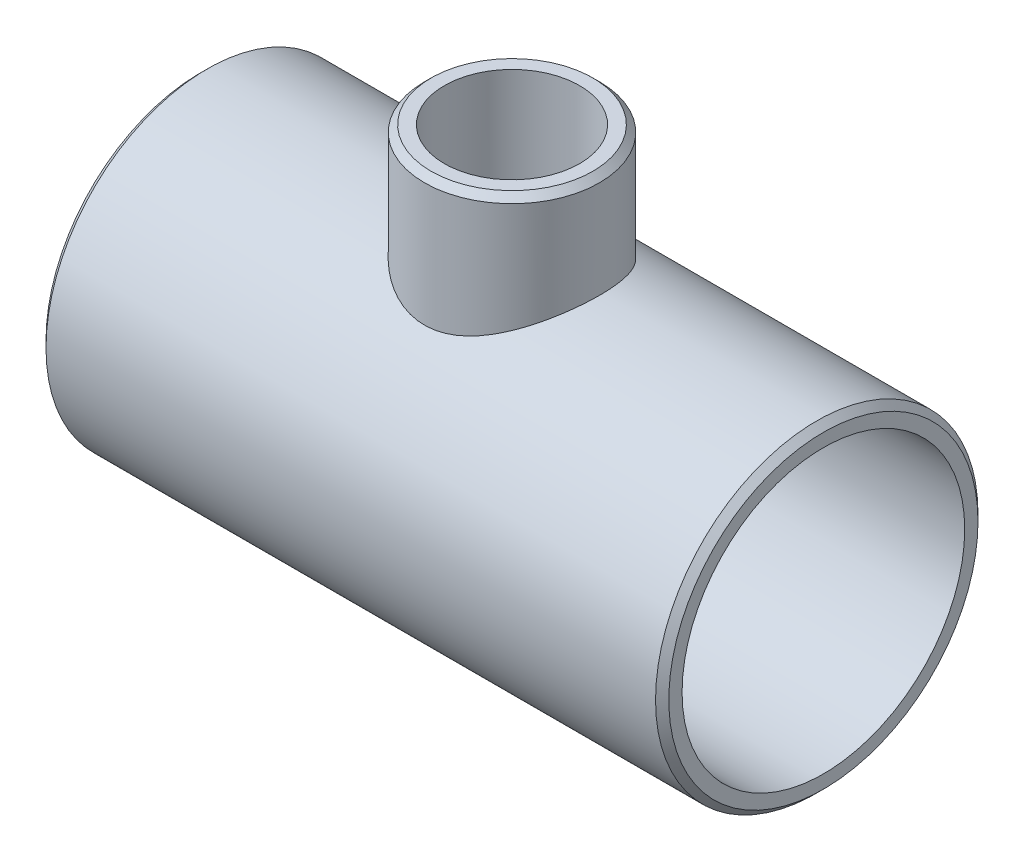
ISO-10303-21;
HEADER;
FILE_DESCRIPTION(('STEP AP214'),'2;1');
FILE_NAME('part.step','',(''),(''),'','','');
FILE_SCHEMA(('AUTOMOTIVE_DESIGN { 1 0 10303 214 1 1 1 1 }'));
ENDSEC;
DATA;
#1=APPLICATION_CONTEXT('core data for automotive mechanical design processes');
#2=APPLICATION_PROTOCOL_DEFINITION('international standard','automotive_design',2000,#1);
#3=PRODUCT_CONTEXT('',#1,'mechanical');
#4=PRODUCT('Part','Part','',(#3));
#5=PRODUCT_RELATED_PRODUCT_CATEGORY('part','',(#4));
#6=PRODUCT_DEFINITION_FORMATION('','',#4);
#7=PRODUCT_DEFINITION_CONTEXT('part definition',#1,'design');
#8=PRODUCT_DEFINITION('design','',#6,#7);
#9=PRODUCT_DEFINITION_SHAPE('','',#8);
#10=(LENGTH_UNIT() NAMED_UNIT(*) SI_UNIT(.MILLI.,.METRE.));
#11=(NAMED_UNIT(*) PLANE_ANGLE_UNIT() SI_UNIT($,.RADIAN.));
#12=(NAMED_UNIT(*) SI_UNIT($,.STERADIAN.) SOLID_ANGLE_UNIT());
#13=UNCERTAINTY_MEASURE_WITH_UNIT(LENGTH_MEASURE(1.E-05),#10,'distance_accuracy_value','');
#14=(GEOMETRIC_REPRESENTATION_CONTEXT(3) GLOBAL_UNCERTAINTY_ASSIGNED_CONTEXT((#13)) GLOBAL_UNIT_ASSIGNED_CONTEXT((#10,
#11,#12)) REPRESENTATION_CONTEXT('',''));
#15=CARTESIAN_POINT('',(0.,0.,0.));
#16=DIRECTION('',(0.,0.,1.));
#17=DIRECTION('',(1.,0.,0.));
#18=AXIS2_PLACEMENT_3D('',#15,#16,#17);
#19=CARTESIAN_POINT('',(-85.852,0.,0.));
#20=DIRECTION('',(-1.,0.,0.));
#21=DIRECTION('',(0.,0.,-1.));
#22=AXIS2_PLACEMENT_3D('',#19,#20,#21);
#23=PLANE('',#22);
#24=CARTESIAN_POINT('',(-85.852,0.,0.));
#25=DIRECTION('',(-1.,0.,0.));
#26=DIRECTION('',(0.,0.,1.));
#27=AXIS2_PLACEMENT_3D('',#24,#25,#26);
#28=CIRCLE('',#27,42.6212);
#29=CARTESIAN_POINT('',(-85.852,0.,42.6212));
#30=VERTEX_POINT('',#29);
#31=EDGE_CURVE('E37',#30,#30,#28,.T.);
#32=ORIENTED_EDGE('',*,*,#31,.T.);
#33=EDGE_LOOP('',(#32));
#34=FACE_BOUND('',#33,.T.);
#35=CARTESIAN_POINT('',(-85.852,0.,0.));
#36=DIRECTION('',(-1.,0.,0.));
#37=DIRECTION('',(0.,0.,1.));
#38=AXIS2_PLACEMENT_3D('',#35,#36,#37);
#39=CIRCLE('',#38,38.9636);
#40=CARTESIAN_POINT('',(-85.852,0.,38.9636));
#41=VERTEX_POINT('',#40);
#42=EDGE_CURVE('E90',#41,#41,#39,.F.);
#43=ORIENTED_EDGE('',*,*,#42,.T.);
#44=EDGE_LOOP('',(#43));
#45=FACE_BOUND('',#44,.T.);
#46=ADVANCED_FACE('F30',(#34,#45),#23,.T.);
#47=CARTESIAN_POINT('',(85.852,0.,0.));
#48=DIRECTION('',(-1.,0.,0.));
#49=DIRECTION('',(0.,0.,1.));
#50=AXIS2_PLACEMENT_3D('',#47,#48,#49);
#51=CYLINDRICAL_SURFACE('',#50,44.45);
#52=CARTESIAN_POINT('',(-84.0232,0.,0.));
#53=DIRECTION('',(-1.,0.,0.));
#54=DIRECTION('',(0.,0.,1.));
#55=AXIS2_PLACEMENT_3D('',#52,#53,#54);
#56=CIRCLE('',#55,44.45);
#57=CARTESIAN_POINT('',(-84.0232,0.,44.45));
#58=VERTEX_POINT('',#57);
#59=EDGE_CURVE('E41',#58,#58,#56,.F.);
#60=ORIENTED_EDGE('',*,*,#59,.T.);
#61=EDGE_LOOP('',(#60));
#62=FACE_BOUND('',#61,.T.);
#63=CARTESIAN_POINT('',(84.0232,0.,0.));
#64=DIRECTION('',(1.,0.,0.));
#65=DIRECTION('',(0.,0.,-1.));
#66=AXIS2_PLACEMENT_3D('',#63,#64,#65);
#67=CIRCLE('',#66,44.45);
#68=CARTESIAN_POINT('',(84.0232,0.,-44.45));
#69=VERTEX_POINT('',#68);
#70=EDGE_CURVE('E45',#69,#69,#67,.F.);
#71=ORIENTED_EDGE('',*,*,#70,.T.);
#72=EDGE_LOOP('',(#71));
#73=FACE_BOUND('',#72,.T.);
#74=CARTESIAN_POINT('',(0.,37.3302236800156,-24.13));
#75=CARTESIAN_POINT('',(-0.62016034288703,37.3302174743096,-24.1300047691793));
#76=CARTESIAN_POINT('',(-1.24026725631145,37.3457277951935,-24.1060636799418));
#77=CARTESIAN_POINT('',(-2.47552218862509,37.4071282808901,-24.0106746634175));
#78=CARTESIAN_POINT('',(-3.09066840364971,37.4530290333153,-23.939210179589));
#79=CARTESIAN_POINT('',(-4.3117937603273,37.5734919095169,-23.7496895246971));
#80=CARTESIAN_POINT('',(-4.91775779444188,37.6480968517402,-23.6315637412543));
#81=CARTESIAN_POINT('',(-6.11525354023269,37.8231542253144,-23.3503504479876));
#82=CARTESIAN_POINT('',(-6.70678610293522,37.9236051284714,-23.1872655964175));
#83=CARTESIAN_POINT('',(-7.86827396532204,38.1461967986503,-22.8192039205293));
#84=CARTESIAN_POINT('',(-8.43833967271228,38.268200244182,-22.6144911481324));
#85=CARTESIAN_POINT('',(-9.55785256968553,38.5305323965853,-22.1645738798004));
#86=CARTESIAN_POINT('',(-10.1072995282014,38.6708613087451,-21.9193689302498));
#87=CARTESIAN_POINT('',(-11.1832762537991,38.9659277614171,-21.3904334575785));
#88=CARTESIAN_POINT('',(-11.7098053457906,39.120665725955,-21.1067018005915));
#89=CARTESIAN_POINT('',(-12.7380539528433,39.4406493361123,-20.5025492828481));
#90=CARTESIAN_POINT('',(-13.239771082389,39.6058959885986,-20.1821249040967));
#91=CARTESIAN_POINT('',(-14.2647106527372,39.9596548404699,-19.4730700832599));
#92=CARTESIAN_POINT('',(-14.7852014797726,40.1488575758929,-19.0808313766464));
#93=CARTESIAN_POINT('',(-15.7921094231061,40.5304727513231,-18.2562233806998));
#94=CARTESIAN_POINT('',(-16.2785248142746,40.7228853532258,-17.8238520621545));
#95=CARTESIAN_POINT('',(-17.2154235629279,41.1063696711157,-16.9206873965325));
#96=CARTESIAN_POINT('',(-17.6658870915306,41.2974405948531,-16.449873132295));
#97=CARTESIAN_POINT('',(-18.5283400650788,41.6736656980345,-15.4719927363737));
#98=CARTESIAN_POINT('',(-18.9403280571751,41.8588196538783,-14.9649252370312));
#99=CARTESIAN_POINT('',(-19.7559792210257,42.233901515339,-13.8730073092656));
#100=CARTESIAN_POINT('',(-20.156098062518,42.4229449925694,-13.285195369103));
#101=CARTESIAN_POINT('',(-20.9049552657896,42.7838182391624,-12.072594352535));
#102=CARTESIAN_POINT('',(-21.2536900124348,42.9556467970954,-11.4478026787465));
#103=CARTESIAN_POINT('',(-21.8960076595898,43.277054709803,-10.1654152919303));
#104=CARTESIAN_POINT('',(-22.1896218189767,43.4266466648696,-9.50783844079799));
#105=CARTESIAN_POINT('',(-22.7183400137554,43.699167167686,-8.16424587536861));
#106=CARTESIAN_POINT('',(-22.9534515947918,43.8220991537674,-7.47823384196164));
#107=CARTESIAN_POINT('',(-23.3452468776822,44.0286360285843,-6.14019522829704));
#108=CARTESIAN_POINT('',(-23.5067574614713,44.1146279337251,-5.48994906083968));
#109=CARTESIAN_POINT('',(-23.7754966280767,44.2584106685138,-4.17524872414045));
#110=CARTESIAN_POINT('',(-23.8827279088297,44.3162028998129,-3.51079526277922));
#111=CARTESIAN_POINT('',(-24.0413116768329,44.401867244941,-2.17374780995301));
#112=CARTESIAN_POINT('',(-24.0926985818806,44.4297577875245,-1.50115909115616));
#113=CARTESIAN_POINT('',(-24.138927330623,44.4548423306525,-0.153489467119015));
#114=CARTESIAN_POINT('',(-24.1337734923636,44.4520386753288,0.521591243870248));
#115=CARTESIAN_POINT('',(-24.0704397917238,44.4176893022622,1.79921394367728));
#116=CARTESIAN_POINT('',(-24.0177342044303,44.3891109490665,2.40211684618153));
#117=CARTESIAN_POINT('',(-23.8674891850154,44.3079973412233,3.60063093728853));
#118=CARTESIAN_POINT('',(-23.7699534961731,44.2554640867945,4.19624273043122));
#119=CARTESIAN_POINT('',(-23.5311764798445,44.1276751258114,5.37615002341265));
#120=CARTESIAN_POINT('',(-23.3899336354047,44.052418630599,5.96044512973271));
#121=CARTESIAN_POINT('',(-23.0652672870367,43.8808975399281,7.11403028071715));
#122=CARTESIAN_POINT('',(-22.8818421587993,43.7846321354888,7.68331974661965));
#123=CARTESIAN_POINT('',(-22.4723297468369,43.5720121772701,8.8099132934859));
#124=CARTESIAN_POINT('',(-22.2457864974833,43.4554441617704,9.36701098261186));
#125=CARTESIAN_POINT('',(-21.7534447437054,43.2054740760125,10.4596188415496));
#126=CARTESIAN_POINT('',(-21.4876464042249,43.0720720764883,10.9951291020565));
#127=CARTESIAN_POINT('',(-20.9188089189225,42.7911322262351,12.0422350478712));
#128=CARTESIAN_POINT('',(-20.6157622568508,42.6435915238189,12.5538258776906));
#129=CARTESIAN_POINT('',(-19.9744855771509,42.3372923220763,13.5509510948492));
#130=CARTESIAN_POINT('',(-19.6362523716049,42.1785328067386,14.0364831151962));
#131=CARTESIAN_POINT('',(-18.8888882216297,41.8355596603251,15.0297353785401));
#132=CARTESIAN_POINT('',(-18.4760425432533,41.6504320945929,15.53434840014));
#133=CARTESIAN_POINT('',(-17.6120971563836,41.274450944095,16.5074020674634));
#134=CARTESIAN_POINT('',(-17.1609950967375,41.0835970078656,16.9758404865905));
#135=CARTESIAN_POINT('',(-16.2223309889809,40.7004409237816,17.8750008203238));
#136=CARTESIAN_POINT('',(-15.7347351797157,40.5081375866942,18.305686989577));
#137=CARTESIAN_POINT('',(-14.7255514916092,40.1269135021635,19.1268995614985));
#138=CARTESIAN_POINT('',(-14.2039621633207,39.9379928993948,19.5174242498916));
#139=CARTESIAN_POINT('',(-13.0835413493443,39.5528144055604,20.2873840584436));
#140=CARTESIAN_POINT('',(-12.4819045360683,39.3572794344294,20.6631125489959));
#141=CARTESIAN_POINT('',(-11.243936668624,38.982352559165,21.3620234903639));
#142=CARTESIAN_POINT('',(-10.6076028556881,38.802961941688,21.6852017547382));
#143=CARTESIAN_POINT('',(-9.304293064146,38.4671228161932,22.2755079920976));
#144=CARTESIAN_POINT('',(-8.63734586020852,38.3106533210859,22.5426873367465));
#145=CARTESIAN_POINT('',(-7.27667718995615,38.0270079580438,23.017947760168));
#146=CARTESIAN_POINT('',(-6.58295998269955,37.8998274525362,23.2260381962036));
#147=CARTESIAN_POINT('',(-5.23138154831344,37.6895758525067,23.5655463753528));
#148=CARTESIAN_POINT('',(-4.57516422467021,37.603767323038,23.7018075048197));
#149=CARTESIAN_POINT('',(-3.25018692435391,37.4656573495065,23.9195267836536));
#150=CARTESIAN_POINT('',(-2.58142774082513,37.4133537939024,24.0009883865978));
#151=CARTESIAN_POINT('',(-1.23819677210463,37.3447356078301,24.107618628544));
#152=CARTESIAN_POINT('',(-0.563730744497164,37.3283882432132,24.1328384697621));
#153=CARTESIAN_POINT('',(0.784796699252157,37.3323863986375,24.1266552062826));
#154=CARTESIAN_POINT('',(1.45885814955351,37.352728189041,24.0952578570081));
#155=CARTESIAN_POINT('',(2.70593275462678,37.4237336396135,23.9847892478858));
#156=CARTESIAN_POINT('',(3.27987820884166,37.4697523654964,23.9130095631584));
#157=CARTESIAN_POINT('',(4.41861510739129,37.586554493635,23.7289971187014));
#158=CARTESIAN_POINT('',(4.98340758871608,37.6573350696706,23.6167689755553));
#159=CARTESIAN_POINT('',(6.10059607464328,37.8213873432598,23.3531412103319));
#160=CARTESIAN_POINT('',(6.65298788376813,37.9146665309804,23.2017285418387));
#161=CARTESIAN_POINT('',(7.74228994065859,38.1208937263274,22.861310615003));
#162=CARTESIAN_POINT('',(8.27919913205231,38.2338430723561,22.6723027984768));
#163=CARTESIAN_POINT('',(9.3578168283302,38.4815154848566,22.2494498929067));
#164=CARTESIAN_POINT('',(9.89873795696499,38.6169662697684,22.0140255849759));
#165=CARTESIAN_POINT('',(10.9588868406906,38.9022114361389,21.5059363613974));
#166=CARTESIAN_POINT('',(11.4781123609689,39.0520072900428,21.2332676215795));
#167=CARTESIAN_POINT('',(12.4931490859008,39.3623011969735,20.6523650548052));
#168=CARTESIAN_POINT('',(12.9889523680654,39.522802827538,20.3441193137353));
#169=CARTESIAN_POINT('',(13.9553711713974,39.8508639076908,19.6937506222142));
#170=CARTESIAN_POINT('',(14.4259848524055,40.0184238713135,19.3516252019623));
#171=CARTESIAN_POINT('',(15.4108232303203,40.3831510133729,18.5798979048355));
#172=CARTESIAN_POINT('',(15.9206370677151,40.5809112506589,18.1449325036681));
#173=CARTESIAN_POINT('',(16.9024665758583,40.9760537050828,17.2340367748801));
#174=CARTESIAN_POINT('',(17.3744788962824,41.1734358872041,16.7581028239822));
#175=CARTESIAN_POINT('',(18.2785183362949,41.5630047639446,15.7671395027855));
#176=CARTESIAN_POINT('',(18.7105236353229,41.7551885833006,15.2520890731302));
#177=CARTESIAN_POINT('',(19.5316240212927,42.1295195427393,14.1853996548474));
#178=CARTESIAN_POINT('',(19.9207189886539,42.3116666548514,13.6337605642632));
#179=CARTESIAN_POINT('',(20.6702933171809,42.6695809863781,12.4698467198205));
#180=CARTESIAN_POINT('',(21.0285833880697,42.8446514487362,11.8559427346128));
#181=CARTESIAN_POINT('',(21.6915528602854,43.1739072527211,10.5943926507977));
#182=CARTESIAN_POINT('',(21.996229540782,43.3280915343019,9.94674484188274));
#183=CARTESIAN_POINT('',(22.5481874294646,43.6108955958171,8.62265248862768));
#184=CARTESIAN_POINT('',(22.7955158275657,43.739536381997,7.94623216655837));
#185=CARTESIAN_POINT('',(23.22971967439,43.9673886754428,6.56945924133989));
#186=CARTESIAN_POINT('',(23.416603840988,44.0666044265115,5.86911010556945));
#187=CARTESIAN_POINT('',(23.7114588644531,44.224032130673,4.52216606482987));
#188=CARTESIAN_POINT('',(23.8254789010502,44.2853659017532,3.87725514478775));
#189=CARTESIAN_POINT('',(24.0008089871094,44.3799385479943,2.57826860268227));
#190=CARTESIAN_POINT('',(24.0621226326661,44.4131793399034,1.92419360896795));
#191=CARTESIAN_POINT('',(24.1311542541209,44.450617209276,0.612667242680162));
#192=CARTESIAN_POINT('',(24.1388945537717,44.4548263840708,-0.0447826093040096));
#193=CARTESIAN_POINT('',(24.1007239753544,44.4341110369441,-1.35764534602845));
#194=CARTESIAN_POINT('',(24.0548155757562,44.4091878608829,-2.01305832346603));
#195=CARTESIAN_POINT('',(23.9162518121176,44.3342945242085,-3.26021809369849));
#196=CARTESIAN_POINT('',(23.827951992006,44.2866604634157,-3.85259654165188));
#197=CARTESIAN_POINT('',(23.608125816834,44.1687739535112,-5.02693734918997));
#198=CARTESIAN_POINT('',(23.4766026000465,44.0985231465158,-5.60890046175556));
#199=CARTESIAN_POINT('',(23.1717402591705,43.9369827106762,-6.75878762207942));
#200=CARTESIAN_POINT('',(22.9983986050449,43.8456918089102,-7.32671081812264));
#201=CARTESIAN_POINT('',(22.6116115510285,43.6440528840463,-8.4452444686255));
#202=CARTESIAN_POINT('',(22.3981642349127,43.533703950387,-8.99585409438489));
#203=CARTESIAN_POINT('',(21.924745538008,43.2919989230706,-10.0962309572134));
#204=CARTESIAN_POINT('',(21.6633849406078,43.160033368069,-10.6452659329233));
#205=CARTESIAN_POINT('',(21.101845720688,42.8809298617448,-11.7190504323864));
#206=CARTESIAN_POINT('',(20.8016666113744,42.7337917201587,-12.243799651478));
#207=CARTESIAN_POINT('',(20.1645438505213,42.4273073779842,-13.2669275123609));
#208=CARTESIAN_POINT('',(19.827589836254,42.2679577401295,-13.7652986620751));
#209=CARTESIAN_POINT('',(19.1190091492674,41.9402364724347,-14.7336491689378));
#210=CARTESIAN_POINT('',(18.7473788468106,41.7718638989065,-15.2036255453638));
#211=CARTESIAN_POINT('',(17.9274619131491,41.4100138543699,-16.1649610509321));
#212=CARTESIAN_POINT('',(17.4752591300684,41.2158506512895,-16.6527276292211));
#213=CARTESIAN_POINT('',(16.5326887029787,40.8251324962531,-17.5888711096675));
#214=CARTESIAN_POINT('',(16.0423181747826,40.628577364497,-18.0372450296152));
#215=CARTESIAN_POINT('',(15.0250855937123,40.2377690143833,-18.8930138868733));
#216=CARTESIAN_POINT('',(14.4981813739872,40.0435187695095,-19.3003600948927));
#217=CARTESIAN_POINT('',(13.4106542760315,39.6627263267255,-20.0712603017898));
#218=CARTESIAN_POINT('',(12.8500331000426,39.4761837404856,-20.4348165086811));
#219=CARTESIAN_POINT('',(11.6621001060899,39.1051497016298,-21.1366231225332));
#220=CARTESIAN_POINT('',(11.0328064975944,38.9214812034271,-21.4719666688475));
#221=CARTESIAN_POINT('',(9.74200471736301,38.5754553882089,-22.0875881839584));
#222=CARTESIAN_POINT('',(9.0804910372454,38.4131017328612,-22.367856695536));
#223=CARTESIAN_POINT('',(7.73135599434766,38.1167656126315,-22.8691790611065));
#224=CARTESIAN_POINT('',(7.04381306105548,37.9827048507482,-23.0903967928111));
#225=CARTESIAN_POINT('',(5.64659404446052,37.7485887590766,-23.471187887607));
#226=CARTESIAN_POINT('',(4.93693264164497,37.6485113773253,-23.6308012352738));
#227=CARTESIAN_POINT('',(3.52616960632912,37.490066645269,-23.881345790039));
#228=CARTESIAN_POINT('',(2.82559802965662,37.4303962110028,-23.9744287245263));
#229=CARTESIAN_POINT('',(1.41666111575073,37.3504780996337,-24.0987533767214));
#230=CARTESIAN_POINT('',(0.708295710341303,37.3302307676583,-24.1299945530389));
#231=CARTESIAN_POINT('',(0.,37.3302236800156,-24.13));
#232=B_SPLINE_CURVE_WITH_KNOTS('',3,(#74,#75,#76,#77,#78,#79,#80,#81,#82,#83,#84,#85,#86,#87,
#88,#89,#90,#91,#92,#93,#94,#95,#96,#97,#98,#99,#100,#101,#102,#103,#104,#105,#106,#107,#108,
#109,#110,#111,#112,#113,#114,#115,#116,#117,#118,#119,#120,#121,#122,#123,#124,#125,#126,#127,
#128,#129,#130,#131,#132,#133,#134,#135,#136,#137,#138,#139,#140,#141,#142,#143,#144,#145,#146,
#147,#148,#149,#150,#151,#152,#153,#154,#155,#156,#157,#158,#159,#160,#161,#162,#163,#164,#165,
#166,#167,#168,#169,#170,#171,#172,#173,#174,#175,#176,#177,#178,#179,#180,#181,#182,#183,#184,
#185,#186,#187,#188,#189,#190,#191,#192,#193,#194,#195,#196,#197,#198,#199,#200,#201,#202,#203,
#204,#205,#206,#207,#208,#209,#210,#211,#212,#213,#214,#215,#216,#217,#218,#219,#220,#221,#222,
#223,#224,#225,#226,#227,#228,#229,#230,#231),.UNSPECIFIED.,.T.,.F.,(4,2,2,2,2,2,2,2,2,2,2,2,2,
2,2,2,2,2,2,2,2,2,2,2,2,2,2,2,2,2,2,2,2,2,2,2,2,2,2,2,2,2,2,2,2,2,2,2,2,2,2,2,2,2,2,2,2,2,2,2,2,
2,2,2,2,2,2,2,2,2,2,2,2,2,2,2,2,2,4),(0.,1.85974112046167,3.7201304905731,5.58330585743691,
7.44637108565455,9.29796793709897,11.1495855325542,13.0012576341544,14.8531074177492,
16.8869351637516,18.9208658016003,20.9559105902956,22.9910321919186,25.1954712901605,
27.4000654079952,29.6034054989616,31.8064612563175,33.8301502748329,35.8537386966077,
37.8760792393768,39.8982653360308,41.7137397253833,43.5290625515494,45.3444483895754,
47.159904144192,48.9957475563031,50.8315832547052,52.6677900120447,54.5041632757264,
56.5352770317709,58.5665157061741,60.5996573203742,62.6328856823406,64.8374231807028,
67.04213621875,69.2448177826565,71.4471503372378,73.4711872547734,75.4950966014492,
77.5171626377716,79.5390231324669,81.2777572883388,83.0162930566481,84.7554084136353,
86.4946421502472,88.3087050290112,90.1229543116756,91.9378129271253,93.7528039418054,
95.8466915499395,97.9407645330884,100.035973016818,102.131187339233,104.324389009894,
106.517701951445,108.709203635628,110.900389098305,112.871043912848,114.841564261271,
116.811263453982,118.78087165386,120.581246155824,122.381489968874,124.181842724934,
125.982281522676,127.847015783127,129.711773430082,131.577057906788,133.4425378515,
135.518985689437,137.595590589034,139.674633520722,141.753571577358,143.959635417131,
146.166077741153,148.366331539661,150.565154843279,152.689178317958,154.813220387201),.UNSPECIFIED.);
#233=CARTESIAN_POINT('',(0.,37.3302236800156,-24.13));
#234=VERTEX_POINT('',#233);
#235=EDGE_CURVE('E56',#234,#234,#232,.T.);
#236=ORIENTED_EDGE('',*,*,#235,.F.);
#237=EDGE_LOOP('',(#236));
#238=FACE_BOUND('',#237,.T.);
#239=ADVANCED_FACE('F66',(#62,#73,#238),#51,.T.);
#240=CARTESIAN_POINT('',(85.852,0.,0.));
#241=DIRECTION('',(1.,0.,0.));
#242=DIRECTION('',(0.,0.,-1.));
#243=AXIS2_PLACEMENT_3D('',#240,#241,#242);
#244=PLANE('',#243);
#245=CARTESIAN_POINT('',(85.852,0.,0.));
#246=DIRECTION('',(1.,0.,0.));
#247=DIRECTION('',(0.,0.,-1.));
#248=AXIS2_PLACEMENT_3D('',#245,#246,#247);
#249=CIRCLE('',#248,42.6212);
#250=CARTESIAN_POINT('',(85.852,0.,-42.6212));
#251=VERTEX_POINT('',#250);
#252=EDGE_CURVE('E10',#251,#251,#249,.T.);
#253=ORIENTED_EDGE('',*,*,#252,.T.);
#254=EDGE_LOOP('',(#253));
#255=FACE_BOUND('',#254,.T.);
#256=CARTESIAN_POINT('',(85.852,0.,0.));
#257=DIRECTION('',(1.,0.,0.));
#258=DIRECTION('',(0.,0.,-1.));
#259=AXIS2_PLACEMENT_3D('',#256,#257,#258);
#260=CIRCLE('',#259,38.9636);
#261=CARTESIAN_POINT('',(85.852,0.,-38.9636));
#262=VERTEX_POINT('',#261);
#263=EDGE_CURVE('E88',#262,#262,#260,.T.);
#264=ORIENTED_EDGE('',*,*,#263,.F.);
#265=EDGE_LOOP('',(#264));
#266=FACE_BOUND('',#265,.T.);
#267=ADVANCED_FACE('F76',(#255,#266),#244,.T.);
#268=CARTESIAN_POINT('',(0.,73.152,0.));
#269=DIRECTION('',(0.,-1.,0.));
#270=DIRECTION('',(0.,0.,-1.));
#271=AXIS2_PLACEMENT_3D('',#268,#269,#270);
#272=CYLINDRICAL_SURFACE('',#271,24.13);
#273=CARTESIAN_POINT('',(0.,71.3232,0.));
#274=DIRECTION('',(0.,1.,0.));
#275=DIRECTION('',(0.,0.,1.));
#276=AXIS2_PLACEMENT_3D('',#273,#274,#275);
#277=CIRCLE('',#276,24.13);
#278=CARTESIAN_POINT('',(0.,71.3232,24.13));
#279=VERTEX_POINT('',#278);
#280=EDGE_CURVE('E50',#279,#279,#277,.F.);
#281=ORIENTED_EDGE('',*,*,#280,.T.);
#282=EDGE_LOOP('',(#281));
#283=FACE_BOUND('',#282,.T.);
#284=ORIENTED_EDGE('',*,*,#235,.T.);
#285=EDGE_LOOP('',(#284));
#286=FACE_BOUND('',#285,.T.);
#287=ADVANCED_FACE('F70',(#283,#286),#272,.T.);
#288=CARTESIAN_POINT('',(0.,73.152,0.));
#289=DIRECTION('',(0.,1.,0.));
#290=DIRECTION('',(0.,0.,1.));
#291=AXIS2_PLACEMENT_3D('',#288,#289,#290);
#292=PLANE('',#291);
#293=CARTESIAN_POINT('',(0.,73.152,0.));
#294=DIRECTION('',(0.,1.,0.));
#295=DIRECTION('',(0.,0.,1.));
#296=AXIS2_PLACEMENT_3D('',#293,#294,#295);
#297=CIRCLE('',#296,22.3012);
#298=CARTESIAN_POINT('',(0.,73.152,22.3012));
#299=VERTEX_POINT('',#298);
#300=EDGE_CURVE('E53',#299,#299,#297,.T.);
#301=ORIENTED_EDGE('',*,*,#300,.T.);
#302=EDGE_LOOP('',(#301));
#303=FACE_BOUND('',#302,.T.);
#304=CARTESIAN_POINT('',(0.,73.152,0.));
#305=DIRECTION('',(0.,1.,0.));
#306=DIRECTION('',(0.,0.,1.));
#307=AXIS2_PLACEMENT_3D('',#304,#305,#306);
#308=CIRCLE('',#307,18.6436);
#309=CARTESIAN_POINT('',(0.,73.152,18.6436));
#310=VERTEX_POINT('',#309);
#311=EDGE_CURVE('E64',#310,#310,#308,.T.);
#312=ORIENTED_EDGE('',*,*,#311,.F.);
#313=EDGE_LOOP('',(#312));
#314=FACE_BOUND('',#313,.T.);
#315=ADVANCED_FACE('F75',(#303,#314),#292,.T.);
#316=CARTESIAN_POINT('',(85.852,0.,0.));
#317=DIRECTION('',(-1.,0.,0.));
#318=DIRECTION('',(0.,0.,1.));
#319=AXIS2_PLACEMENT_3D('',#316,#317,#318);
#320=CYLINDRICAL_SURFACE('',#319,38.9636);
#321=ORIENTED_EDGE('',*,*,#42,.F.);
#322=EDGE_LOOP('',(#321));
#323=FACE_BOUND('',#322,.T.);
#324=ORIENTED_EDGE('',*,*,#263,.T.);
#325=EDGE_LOOP('',(#324));
#326=FACE_BOUND('',#325,.T.);
#327=CARTESIAN_POINT('',(1.76904412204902,34.2594194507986,18.5594801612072));
#328=CARTESIAN_POINT('',(2.27005178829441,34.2852947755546,18.511721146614));
#329=CARTESIAN_POINT('',(2.76869139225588,34.3220373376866,18.44369501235));
#330=CARTESIAN_POINT('',(3.75720921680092,34.4158750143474,18.2679912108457));
#331=CARTESIAN_POINT('',(4.24708173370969,34.4729829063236,18.1602886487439));
#332=CARTESIAN_POINT('',(5.21546552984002,34.6056173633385,17.9062538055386));
#333=CARTESIAN_POINT('',(5.69394534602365,34.6811896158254,17.7598256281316));
#334=CARTESIAN_POINT('',(6.63507249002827,34.8480696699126,17.4300962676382));
#335=CARTESIAN_POINT('',(7.09772200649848,34.9393752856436,17.2468002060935));
#336=CARTESIAN_POINT('',(8.00209941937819,35.134284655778,16.8461709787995));
#337=CARTESIAN_POINT('',(8.44392984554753,35.2378167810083,16.6290338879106));
#338=CARTESIAN_POINT('',(9.30723077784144,35.4545938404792,16.1616901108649));
#339=CARTESIAN_POINT('',(9.72870076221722,35.5678390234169,15.9114825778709));
#340=CARTESIAN_POINT('',(10.5492404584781,35.8009785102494,15.3797363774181));
#341=CARTESIAN_POINT('',(10.9483168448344,35.9208708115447,15.0982071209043));
#342=CARTESIAN_POINT('',(11.7224881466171,36.1643469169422,14.505338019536));
#343=CARTESIAN_POINT('',(12.0975817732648,36.2879309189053,14.1939965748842));
#344=CARTESIAN_POINT('',(12.8509573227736,36.5457294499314,13.5171415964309));
#345=CARTESIAN_POINT('',(13.2271194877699,36.6800076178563,13.149288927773));
#346=CARTESIAN_POINT('',(13.9474782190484,36.9458844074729,12.3825837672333));
#347=CARTESIAN_POINT('',(14.2916731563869,37.0774828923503,11.9837296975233));
#348=CARTESIAN_POINT('',(14.9460289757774,37.3345889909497,11.1569716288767));
#349=CARTESIAN_POINT('',(15.2561808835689,37.4600949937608,10.7290600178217));
#350=CARTESIAN_POINT('',(15.8401062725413,37.7016791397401,9.84656169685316));
#351=CARTESIAN_POINT('',(16.113880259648,37.8177574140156,9.39197535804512));
#352=CARTESIAN_POINT('',(16.6261984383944,38.0388570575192,8.45242379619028));
#353=CARTESIAN_POINT('',(16.864217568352,38.1437081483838,7.96713149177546));
#354=CARTESIAN_POINT('',(17.2981680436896,38.3375431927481,6.97497990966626));
#355=CARTESIAN_POINT('',(17.4940984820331,38.426526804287,6.46812016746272));
#356=CARTESIAN_POINT('',(17.8415169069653,38.585932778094,5.43690268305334));
#357=CARTESIAN_POINT('',(17.9930337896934,38.6563672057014,4.91255656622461));
#358=CARTESIAN_POINT('',(18.2498500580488,38.7765705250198,3.85035700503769));
#359=CARTESIAN_POINT('',(18.3551543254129,38.8263415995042,3.31250499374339));
#360=CARTESIAN_POINT('',(18.5108990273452,38.9002243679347,2.27603078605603));
#361=CARTESIAN_POINT('',(18.5653666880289,38.9262154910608,1.7781440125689));
#362=CARTESIAN_POINT('',(18.6340471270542,38.959018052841,0.778982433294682));
#363=CARTESIAN_POINT('',(18.648262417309,38.9658306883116,0.277707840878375));
#364=CARTESIAN_POINT('',(18.6362651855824,38.960090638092,-0.724121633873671));
#365=CARTESIAN_POINT('',(18.6100621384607,38.9475424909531,-1.22467665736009));
#366=CARTESIAN_POINT('',(18.5175706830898,38.9034326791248,-2.22121436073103));
#367=CARTESIAN_POINT('',(18.4512828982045,38.871871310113,-2.7171971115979));
#368=CARTESIAN_POINT('',(18.2839747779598,38.7927432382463,-3.67473683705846));
#369=CARTESIAN_POINT('',(18.1849772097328,38.7461114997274,-4.13672700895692));
#370=CARTESIAN_POINT('',(17.9527622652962,38.6376686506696,-5.0501696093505));
#371=CARTESIAN_POINT('',(17.8195464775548,38.5758582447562,-5.50162252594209));
#372=CARTESIAN_POINT('',(17.5201343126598,38.4384667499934,-6.39132687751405));
#373=CARTESIAN_POINT('',(17.3539347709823,38.3628843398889,-6.8295770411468));
#374=CARTESIAN_POINT('',(16.9899801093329,38.1996241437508,-7.69043654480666));
#375=CARTESIAN_POINT('',(16.7922235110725,38.1119457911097,-8.11304515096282));
#376=CARTESIAN_POINT('',(16.3562831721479,37.921840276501,-8.96068622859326));
#377=CARTESIAN_POINT('',(16.1165982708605,37.8189023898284,-9.38483192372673));
#378=CARTESIAN_POINT('',(15.6059529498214,37.6041277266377,-10.2114694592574));
#379=CARTESIAN_POINT('',(15.3349918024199,37.4922907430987,-10.6139607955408));
#380=CARTESIAN_POINT('',(14.7634516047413,37.2621707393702,-11.3955596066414));
#381=CARTESIAN_POINT('',(14.4628637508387,37.143885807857,-11.7746600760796));
#382=CARTESIAN_POINT('',(13.833722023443,36.9034637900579,-12.5078133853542));
#383=CARTESIAN_POINT('',(13.5051581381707,36.781325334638,-12.8618571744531));
#384=CARTESIAN_POINT('',(12.7905347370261,36.5247169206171,-13.5743634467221));
#385=CARTESIAN_POINT('',(12.4019648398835,36.3901398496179,-13.9302742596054));
#386=CARTESIAN_POINT('',(11.5956100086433,36.1232852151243,-14.6083256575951));
#387=CARTESIAN_POINT('',(11.1778225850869,35.9910078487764,-14.9304633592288));
#388=CARTESIAN_POINT('',(10.3149429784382,35.7324345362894,-15.5391331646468));
#389=CARTESIAN_POINT('',(9.86983641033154,35.60614180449,-15.8256462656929));
#390=CARTESIAN_POINT('',(8.95501604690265,35.3634875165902,-16.3606895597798));
#391=CARTESIAN_POINT('',(8.48531298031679,35.2471216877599,-16.6092361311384));
#392=CARTESIAN_POINT('',(7.51762945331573,35.0266810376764,-17.0692608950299));
#393=CARTESIAN_POINT('',(7.01936585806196,34.9227808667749,-17.2802288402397));
#394=CARTESIAN_POINT('',(6.00331821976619,34.7328256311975,-17.6589323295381));
#395=CARTESIAN_POINT('',(5.48553383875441,34.6467708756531,-17.8266671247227));
#396=CARTESIAN_POINT('',(4.43491433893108,34.4960415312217,-18.1166214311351));
#397=CARTESIAN_POINT('',(3.90209628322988,34.4313436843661,-18.2388904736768));
#398=CARTESIAN_POINT('',(2.82548411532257,34.3260090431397,-18.436372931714));
#399=CARTESIAN_POINT('',(2.28169156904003,34.2853688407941,-18.5115930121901));
#400=CARTESIAN_POINT('',(1.24715980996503,34.2329688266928,-18.6082933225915));
#401=CARTESIAN_POINT('',(0.757006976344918,34.2185723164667,-18.634684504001));
#402=CARTESIAN_POINT('',(-0.22400007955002,34.2109338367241,-18.6487057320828));
#403=CARTESIAN_POINT('',(-0.714854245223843,34.2176902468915,-18.6363387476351));
#404=CARTESIAN_POINT('',(-1.69329043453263,34.2521014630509,-18.5730165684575));
#405=CARTESIAN_POINT('',(-2.18087260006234,34.2797553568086,-18.5220630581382));
#406=CARTESIAN_POINT('',(-3.14900210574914,34.3549354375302,-18.3822418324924));
#407=CARTESIAN_POINT('',(-3.62954944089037,34.4024616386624,-18.2933740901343));
#408=CARTESIAN_POINT('',(-4.5541298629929,34.5125960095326,-18.0846877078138));
#409=CARTESIAN_POINT('',(-4.9987231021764,34.5742378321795,-17.9668262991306));
#410=CARTESIAN_POINT('',(-5.87609966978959,34.7119439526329,-17.6993132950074));
#411=CARTESIAN_POINT('',(-6.30887886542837,34.7880132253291,-17.5496507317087));
#412=CARTESIAN_POINT('',(-7.16015620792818,34.9524206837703,-17.2198815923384));
#413=CARTESIAN_POINT('',(-7.57865682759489,35.040756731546,-17.0397803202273));
#414=CARTESIAN_POINT('',(-8.39972757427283,35.2274578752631,-16.6503742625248));
#415=CARTESIAN_POINT('',(-8.80229043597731,35.3258274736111,-16.4410563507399));
#416=CARTESIAN_POINT('',(-9.62469927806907,35.5392980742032,-15.9747261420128));
#417=CARTESIAN_POINT('',(-10.0428954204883,35.65510899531,-15.715127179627));
#418=CARTESIAN_POINT('',(-10.8563418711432,35.8927165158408,-15.1645937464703));
#419=CARTESIAN_POINT('',(-11.2515904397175,36.0145135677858,-14.8736569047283));
#420=CARTESIAN_POINT('',(-12.0176531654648,36.2611456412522,-14.2618469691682));
#421=CARTESIAN_POINT('',(-12.3884504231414,36.3859826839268,-13.9409535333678));
#422=CARTESIAN_POINT('',(-13.1035141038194,36.6356132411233,-13.2710847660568));
#423=CARTESIAN_POINT('',(-13.4477887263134,36.7604067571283,-12.922118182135));
#424=CARTESIAN_POINT('',(-14.1396039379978,37.0188355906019,-12.1632003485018));
#425=CARTESIAN_POINT('',(-14.4843569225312,37.1521868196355,-11.7506041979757));
#426=CARTESIAN_POINT('',(-15.137917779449,37.4118284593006,-10.8957227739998));
#427=CARTESIAN_POINT('',(-15.4467231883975,37.5381183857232,-10.4534354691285));
#428=CARTESIAN_POINT('',(-16.0259544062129,37.7801572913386,-9.54171016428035));
#429=CARTESIAN_POINT('',(-16.2963844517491,37.8959074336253,-9.07227516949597));
#430=CARTESIAN_POINT('',(-16.7964507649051,38.1136245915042,-8.10909675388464));
#431=CARTESIAN_POINT('',(-17.0260894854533,38.2155924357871,-7.61535479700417));
#432=CARTESIAN_POINT('',(-17.436272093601,38.4001210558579,-6.62125854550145));
#433=CARTESIAN_POINT('',(-17.6180263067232,38.4831512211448,-6.12149147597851));
#434=CARTESIAN_POINT('',(-17.9387465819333,38.6310323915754,-5.10576044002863));
#435=CARTESIAN_POINT('',(-18.0777130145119,38.695883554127,-4.58979661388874));
#436=CARTESIAN_POINT('',(-18.3110523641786,38.8054419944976,-3.54611379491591));
#437=CARTESIAN_POINT('',(-18.4054537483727,38.850162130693,-3.01840253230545));
#438=CARTESIAN_POINT('',(-18.5485170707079,38.9181423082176,-1.9554616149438));
#439=CARTESIAN_POINT('',(-18.5971831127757,38.9414042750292,-1.42023263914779));
#440=CARTESIAN_POINT('',(-18.645758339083,38.9646281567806,-0.396643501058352));
#441=CARTESIAN_POINT('',(-18.6497525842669,38.9665422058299,0.09148366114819));
#442=CARTESIAN_POINT('',(-18.6194696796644,38.952057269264,1.06625365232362));
#443=CARTESIAN_POINT('',(-18.5851952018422,38.9356595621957,1.55289658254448));
#444=CARTESIAN_POINT('',(-18.4787817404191,38.8849778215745,2.52103236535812));
#445=CARTESIAN_POINT('',(-18.406645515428,38.8506950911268,3.0025255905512));
#446=CARTESIAN_POINT('',(-18.2253232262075,38.7651174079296,3.95693918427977));
#447=CARTESIAN_POINT('',(-18.116136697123,38.7138222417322,4.42985944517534));
#448=CARTESIAN_POINT('',(-17.8647104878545,38.5968146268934,5.35349553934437));
#449=CARTESIAN_POINT('',(-17.7232615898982,38.5314489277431,5.80447133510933));
#450=CARTESIAN_POINT('',(-17.4073817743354,38.3871789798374,6.69245551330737));
#451=CARTESIAN_POINT('',(-17.2329516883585,38.308275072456,7.12946424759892));
#452=CARTESIAN_POINT('',(-16.8525460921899,38.1386632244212,7.98721941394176));
#453=CARTESIAN_POINT('',(-16.6465654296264,38.0479533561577,8.40796317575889));
#454=CARTESIAN_POINT('',(-16.2046184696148,37.8566808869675,9.23105607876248));
#455=CARTESIAN_POINT('',(-15.9686506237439,37.7561177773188,9.63340426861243));
#456=CARTESIAN_POINT('',(-15.4502174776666,37.5396870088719,10.4462156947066));
#457=CARTESIAN_POINT('',(-15.1656253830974,37.4232385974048,10.8551685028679));
#458=CARTESIAN_POINT('',(-14.5656384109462,37.1841421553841,11.6478810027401));
#459=CARTESIAN_POINT('',(-14.2502422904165,37.0614938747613,12.0316396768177));
#460=CARTESIAN_POINT('',(-13.5903601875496,36.8128072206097,12.7723143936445));
#461=CARTESIAN_POINT('',(-13.2458651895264,36.6867678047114,13.1292220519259));
#462=CARTESIAN_POINT('',(-12.5294635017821,36.4342331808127,13.8145660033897));
#463=CARTESIAN_POINT('',(-12.1575436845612,36.307737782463,14.1429884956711));
#464=CARTESIAN_POINT('',(-11.3569022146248,36.047231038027,14.7950096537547));
#465=CARTESIAN_POINT('',(-10.9260204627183,35.9134433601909,15.1160515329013));
#466=CARTESIAN_POINT('',(-10.0368727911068,35.6530020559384,15.7204915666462));
#467=CARTESIAN_POINT('',(-9.57861947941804,35.526345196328,16.0039068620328));
#468=CARTESIAN_POINT('',(-8.63675747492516,35.2840578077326,16.5312330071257));
#469=CARTESIAN_POINT('',(-8.15313518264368,35.1684332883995,16.7751223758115));
#470=CARTESIAN_POINT('',(-7.16367233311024,34.9523040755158,17.2209169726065));
#471=CARTESIAN_POINT('',(-6.65783408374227,34.8517978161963,17.4228265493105));
#472=CARTESIAN_POINT('',(-5.64276868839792,34.6724268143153,17.7770416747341));
#473=CARTESIAN_POINT('',(-5.13409613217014,34.5930043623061,17.9306510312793));
#474=CARTESIAN_POINT('',(-4.10269832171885,34.4550338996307,18.1943667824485));
#475=CARTESIAN_POINT('',(-3.57997121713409,34.3964886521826,18.3044674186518));
#476=CARTESIAN_POINT('',(-2.52643732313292,34.3028667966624,18.4793205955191));
#477=CARTESIAN_POINT('',(-1.99565754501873,34.2677243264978,18.5442004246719));
#478=CARTESIAN_POINT('',(-0.929697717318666,34.2222086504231,18.6280685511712));
#479=CARTESIAN_POINT('',(-0.394521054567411,34.2118178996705,18.6470893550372));
#480=CARTESIAN_POINT('',(0.41232903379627,34.2151141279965,18.641028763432));
#481=CARTESIAN_POINT('',(0.684297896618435,34.2194805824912,18.6330221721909));
#482=CARTESIAN_POINT('',(1.22742253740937,34.2346492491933,18.6051384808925));
#483=CARTESIAN_POINT('',(1.49857839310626,34.2454508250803,18.5852625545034));
#484=CARTESIAN_POINT('',(1.76904412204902,34.2594194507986,18.5594801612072));
#485=B_SPLINE_CURVE_WITH_KNOTS('',3,(#327,#328,#329,#330,#331,#332,#333,#334,#335,#336,#337,
#338,#339,#340,#341,#342,#343,#344,#345,#346,#347,#348,#349,#350,#351,#352,#353,#354,#355,#356,
#357,#358,#359,#360,#361,#362,#363,#364,#365,#366,#367,#368,#369,#370,#371,#372,#373,#374,#375,
#376,#377,#378,#379,#380,#381,#382,#383,#384,#385,#386,#387,#388,#389,#390,#391,#392,#393,#394,
#395,#396,#397,#398,#399,#400,#401,#402,#403,#404,#405,#406,#407,#408,#409,#410,#411,#412,#413,
#414,#415,#416,#417,#418,#419,#420,#421,#422,#423,#424,#425,#426,#427,#428,#429,#430,#431,#432,
#433,#434,#435,#436,#437,#438,#439,#440,#441,#442,#443,#444,#445,#446,#447,#448,#449,#450,#451,
#452,#453,#454,#455,#456,#457,#458,#459,#460,#461,#462,#463,#464,#465,#466,#467,#468,#469,#470,
#471,#472,#473,#474,#475,#476,#477,#478,#479,#480,#481,#482,#483,#484),.UNSPECIFIED.,.T.,.F.,(4,
2,2,2,2,2,2,2,2,2,2,2,2,2,2,2,2,2,2,2,2,2,2,2,2,2,2,2,2,2,2,2,2,2,2,2,2,2,2,2,2,2,2,2,2,2,2,2,2,
2,2,2,2,2,2,2,2,2,2,2,2,2,2,2,2,2,2,2,2,2,2,2,2,2,2,2,2,2,4),(0.,1.51153684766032,
3.02402372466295,4.54029162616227,6.0563490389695,7.56392833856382,9.07154625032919,
10.5787123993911,12.0859594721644,13.7131005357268,15.3403244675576,16.9679763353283,
18.5956055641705,20.2451911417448,21.8948122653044,23.5433577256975,25.1917289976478,
26.6943765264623,28.1969302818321,29.6991318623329,31.2013100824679,32.6240261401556,
34.0466761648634,35.4694627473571,36.8923159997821,38.3845547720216,39.8768282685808,
41.3695465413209,42.8628012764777,44.4924867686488,46.1223112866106,47.7530014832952,
49.3829862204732,51.0336488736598,52.6843401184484,54.3332277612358,55.981881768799,
57.4531659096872,58.9243373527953,60.3954445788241,61.8665528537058,63.2572523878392,
64.6484323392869,66.0393701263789,67.4309348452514,68.9463318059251,70.4618434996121,
71.978391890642,73.4944695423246,75.1543497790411,76.8143436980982,78.4741542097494,
80.1338648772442,81.7463822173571,83.3588855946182,84.9703575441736,86.5816848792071,
88.0443108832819,89.5068347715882,90.9692521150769,92.4316878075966,93.8615343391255,
95.2913448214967,96.7213890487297,98.1515071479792,99.6848499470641,101.218254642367,
102.75213618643,104.286756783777,105.945979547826,107.604443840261,109.263806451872,
110.922997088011,112.532526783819,114.14226943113,115.747462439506,117.351517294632,
118.167591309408,118.983584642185),.UNSPECIFIED.);
#486=CARTESIAN_POINT('',(1.76904412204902,34.2594194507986,18.5594801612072));
#487=VERTEX_POINT('',#486);
#488=EDGE_CURVE('E63',#487,#487,#485,.T.);
#489=ORIENTED_EDGE('',*,*,#488,.T.);
#490=EDGE_LOOP('',(#489));
#491=FACE_BOUND('',#490,.T.);
#492=ADVANCED_FACE('F98',(#323,#326,#491),#320,.F.);
#493=CARTESIAN_POINT('',(0.,73.152,0.));
#494=DIRECTION('',(0.,-1.,0.));
#495=DIRECTION('',(0.,0.,-1.));
#496=AXIS2_PLACEMENT_3D('',#493,#494,#495);
#497=CYLINDRICAL_SURFACE('',#496,18.6436);
#498=ORIENTED_EDGE('',*,*,#311,.T.);
#499=EDGE_LOOP('',(#498));
#500=FACE_BOUND('',#499,.T.);
#501=ORIENTED_EDGE('',*,*,#488,.F.);
#502=EDGE_LOOP('',(#501));
#503=FACE_BOUND('',#502,.T.);
#504=ADVANCED_FACE('F100',(#500,#503),#497,.F.);
#505=CARTESIAN_POINT('',(0.,73.152,0.));
#506=DIRECTION('',(0.,-1.,0.));
#507=DIRECTION('',(0.,0.,-1.));
#508=AXIS2_PLACEMENT_3D('',#505,#506,#507);
#509=CONICAL_SURFACE('',#508,22.3012,0.785398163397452);
#510=ORIENTED_EDGE('',*,*,#280,.F.);
#511=EDGE_LOOP('',(#510));
#512=FACE_BOUND('',#511,.T.);
#513=ORIENTED_EDGE('',*,*,#300,.F.);
#514=EDGE_LOOP('',(#513));
#515=FACE_BOUND('',#514,.T.);
#516=ADVANCED_FACE('F103',(#512,#515),#509,.T.);
#517=CARTESIAN_POINT('',(-84.0232,0.,0.));
#518=DIRECTION('',(1.,0.,0.));
#519=DIRECTION('',(0.,0.,-1.));
#520=AXIS2_PLACEMENT_3D('',#517,#518,#519);
#521=CONICAL_SURFACE('',#520,44.45,0.785398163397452);
#522=ORIENTED_EDGE('',*,*,#31,.F.);
#523=EDGE_LOOP('',(#522));
#524=FACE_BOUND('',#523,.T.);
#525=ORIENTED_EDGE('',*,*,#59,.F.);
#526=EDGE_LOOP('',(#525));
#527=FACE_BOUND('',#526,.T.);
#528=ADVANCED_FACE('F109',(#524,#527),#521,.T.);
#529=CARTESIAN_POINT('',(85.852,0.,0.));
#530=DIRECTION('',(-1.,0.,0.));
#531=DIRECTION('',(0.,0.,1.));
#532=AXIS2_PLACEMENT_3D('',#529,#530,#531);
#533=CONICAL_SURFACE('',#532,42.6212,0.785398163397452);
#534=ORIENTED_EDGE('',*,*,#70,.F.);
#535=EDGE_LOOP('',(#534));
#536=FACE_BOUND('',#535,.T.);
#537=ORIENTED_EDGE('',*,*,#252,.F.);
#538=EDGE_LOOP('',(#537));
#539=FACE_BOUND('',#538,.T.);
#540=ADVANCED_FACE('F32',(#536,#539),#533,.T.);
#541=CLOSED_SHELL('',(#46,#239,#267,#287,#315,#492,#504,#516,#528,#540));
#542=MANIFOLD_SOLID_BREP('B2',#541);
#543=ADVANCED_BREP_SHAPE_REPRESENTATION('',(#18,#542),#14);
#544=SHAPE_DEFINITION_REPRESENTATION(#9,#543);
ENDSEC;
END-ISO-10303-21;
